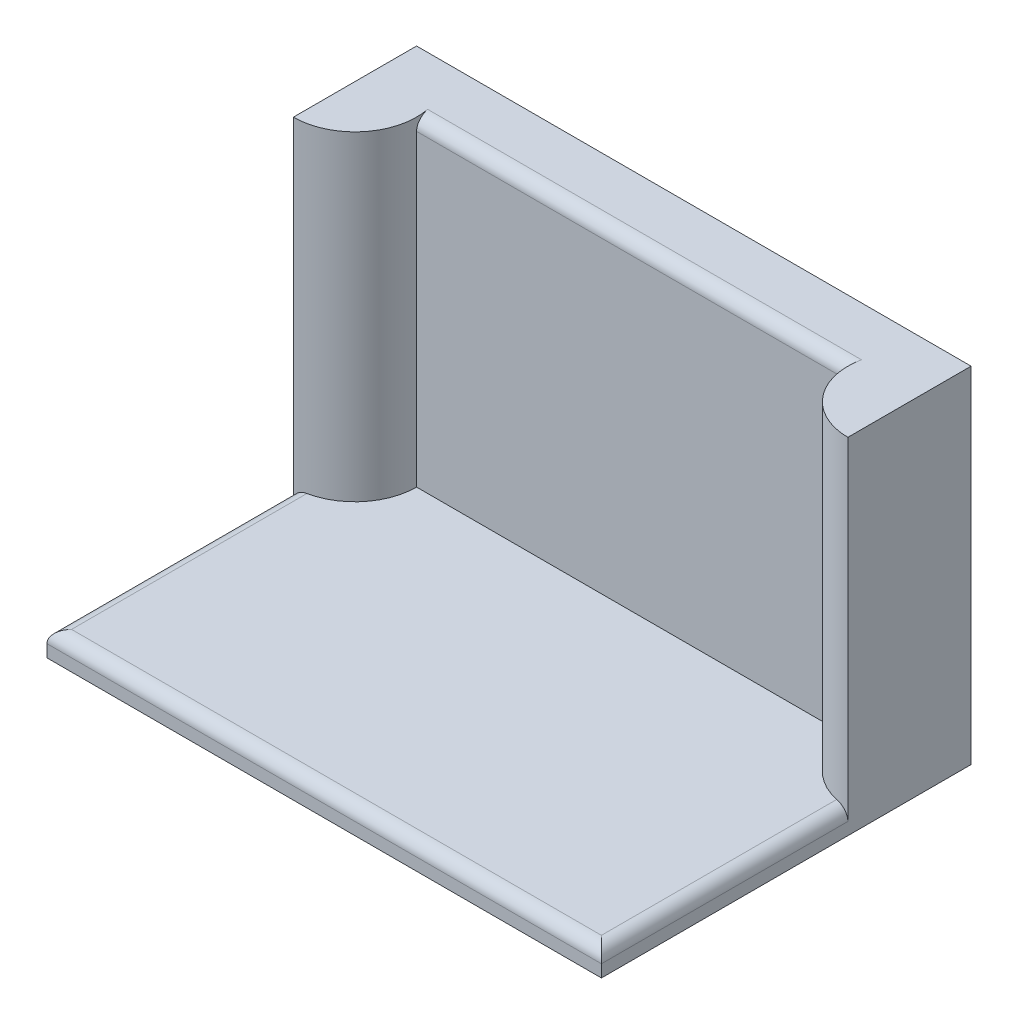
ISO-10303-21;
HEADER;
FILE_DESCRIPTION(('STEP AP214'),'2;1');
FILE_NAME('part.step','',(''),(''),'','','');
FILE_SCHEMA(('AUTOMOTIVE_DESIGN { 1 0 10303 214 1 1 1 1 }'));
ENDSEC;
DATA;
#1=APPLICATION_CONTEXT('core data for automotive mechanical design processes');
#2=APPLICATION_PROTOCOL_DEFINITION('international standard','automotive_design',2000,#1);
#3=PRODUCT_CONTEXT('',#1,'mechanical');
#4=PRODUCT('Part','Part','',(#3));
#5=PRODUCT_RELATED_PRODUCT_CATEGORY('part','',(#4));
#6=PRODUCT_DEFINITION_FORMATION('','',#4);
#7=PRODUCT_DEFINITION_CONTEXT('part definition',#1,'design');
#8=PRODUCT_DEFINITION('design','',#6,#7);
#9=PRODUCT_DEFINITION_SHAPE('','',#8);
#10=(LENGTH_UNIT() NAMED_UNIT(*) SI_UNIT(.MILLI.,.METRE.));
#11=(NAMED_UNIT(*) PLANE_ANGLE_UNIT() SI_UNIT($,.RADIAN.));
#12=(NAMED_UNIT(*) SI_UNIT($,.STERADIAN.) SOLID_ANGLE_UNIT());
#13=UNCERTAINTY_MEASURE_WITH_UNIT(LENGTH_MEASURE(1.E-05),#10,'distance_accuracy_value','');
#14=(GEOMETRIC_REPRESENTATION_CONTEXT(3) GLOBAL_UNCERTAINTY_ASSIGNED_CONTEXT((#13)) GLOBAL_UNIT_ASSIGNED_CONTEXT((#10,
#11,#12)) REPRESENTATION_CONTEXT('',''));
#15=CARTESIAN_POINT('',(0.,0.,0.));
#16=DIRECTION('',(0.,0.,1.));
#17=DIRECTION('',(1.,0.,0.));
#18=AXIS2_PLACEMENT_3D('',#15,#16,#17);
#19=CARTESIAN_POINT('',(450.,-20.4291045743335,36.2809389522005));
#20=DIRECTION('',(1.,0.,0.));
#21=DIRECTION('',(0.,0.,-1.));
#22=AXIS2_PLACEMENT_3D('',#19,#20,#21);
#23=CYLINDRICAL_SURFACE('',#22,10.);
#24=CARTESIAN_POINT('',(440.,-20.4291045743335,36.2809389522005));
#25=DIRECTION('',(0.707106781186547,0.,-0.707106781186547));
#26=DIRECTION('',(-0.707106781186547,0.,-0.707106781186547));
#27=AXIS2_PLACEMENT_3D('',#24,#25,#26);
#28=ELLIPSE('',#27,14.1421356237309,10.);
#29=CARTESIAN_POINT('',(440.,-10.4291045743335,36.2809389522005));
#30=VERTEX_POINT('',#29);
#31=CARTESIAN_POINT('',(450.,-20.4291045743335,46.2809389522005));
#32=VERTEX_POINT('',#31);
#33=EDGE_CURVE('E45',#30,#32,#28,.T.);
#34=ORIENTED_EDGE('',*,*,#33,.F.);
#35=DIRECTION('',(1.,0.,0.));
#36=VECTOR('',#35,1.);
#37=CARTESIAN_POINT('',(450.,-10.4291045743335,36.2809389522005));
#38=LINE('',#37,#36);
#39=CARTESIAN_POINT('',(10.,-10.4291045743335,36.2809389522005));
#40=VERTEX_POINT('',#39);
#41=EDGE_CURVE('E237',#40,#30,#38,.T.);
#42=ORIENTED_EDGE('',*,*,#41,.F.);
#43=CARTESIAN_POINT('',(10.,-20.4291045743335,36.2809389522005));
#44=DIRECTION('',(0.707106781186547,0.,0.707106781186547));
#45=DIRECTION('',(0.707106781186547,0.,-0.707106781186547));
#46=AXIS2_PLACEMENT_3D('',#43,#44,#45);
#47=ELLIPSE('',#46,14.1421356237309,10.);
#48=CARTESIAN_POINT('',(0.,-20.4291045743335,46.2809389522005));
#49=VERTEX_POINT('',#48);
#50=EDGE_CURVE('E216',#40,#49,#47,.T.);
#51=ORIENTED_EDGE('',*,*,#50,.T.);
#52=DIRECTION('',(1.,0.,0.));
#53=VECTOR('',#52,1.);
#54=CARTESIAN_POINT('',(450.,-20.4291045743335,46.2809389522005));
#55=LINE('',#54,#53);
#56=EDGE_CURVE('E239',#32,#49,#55,.F.);
#57=ORIENTED_EDGE('',*,*,#56,.F.);
#58=EDGE_LOOP('',(#34,#42,#51,#57));
#59=FACE_BOUND('',#58,.T.);
#60=ADVANCED_FACE('F33',(#59),#23,.T.);
#61=CARTESIAN_POINT('',(10.,-20.4291045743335,46.2809389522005));
#62=DIRECTION('',(0.,0.,-1.));
#63=DIRECTION('',(-1.,0.,0.));
#64=AXIS2_PLACEMENT_3D('',#61,#62,#63);
#65=CYLINDRICAL_SURFACE('',#64,10.);
#66=ORIENTED_EDGE('',*,*,#50,.F.);
#67=DIRECTION('',(0.,0.,1.));
#68=VECTOR('',#67,1.);
#69=CARTESIAN_POINT('',(10.,-10.4291045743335,46.2809389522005));
#70=LINE('',#69,#68);
#71=CARTESIAN_POINT('',(10.,-10.4291045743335,-154.729266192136));
#72=VERTEX_POINT('',#71);
#73=EDGE_CURVE('E249',#72,#40,#70,.T.);
#74=ORIENTED_EDGE('',*,*,#73,.F.);
#75=CARTESIAN_POINT('',(10.,-10.4291045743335,-154.729266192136));
#76=CARTESIAN_POINT('',(9.72494660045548,-10.4290731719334,-154.673097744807));
#77=CARTESIAN_POINT('',(9.44939749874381,-10.4404518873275,-154.619287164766));
#78=CARTESIAN_POINT('',(8.89924855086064,-10.4860480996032,-154.516611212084));
#79=CARTESIAN_POINT('',(8.62464878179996,-10.5202674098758,-154.467746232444));
#80=CARTESIAN_POINT('',(8.07851953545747,-10.6115406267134,-154.375223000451));
#81=CARTESIAN_POINT('',(7.80698859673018,-10.6685831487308,-154.331562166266));
#82=CARTESIAN_POINT('',(7.26888086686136,-10.8052782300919,-154.249500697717));
#83=CARTESIAN_POINT('',(7.00230381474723,-10.8849295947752,-154.211099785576));
#84=CARTESIAN_POINT('',(6.47579397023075,-11.0665402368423,-154.13948081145));
#85=CARTESIAN_POINT('',(6.21586912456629,-11.1685249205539,-154.106268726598));
#86=CARTESIAN_POINT('',(5.70496619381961,-11.3941356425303,-154.04492731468));
#87=CARTESIAN_POINT('',(5.45398806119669,-11.5177615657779,-154.016797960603));
#88=CARTESIAN_POINT('',(4.96297938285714,-11.7858046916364,-153.965370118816));
#89=CARTESIAN_POINT('',(4.72294533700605,-11.9302151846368,-153.942070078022));
#90=CARTESIAN_POINT('',(4.2555749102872,-12.2388662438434,-153.899936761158));
#91=CARTESIAN_POINT('',(4.02823834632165,-12.4031065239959,-153.881103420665));
#92=CARTESIAN_POINT('',(3.5902521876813,-12.7484724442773,-153.847647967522));
#93=CARTESIAN_POINT('',(3.37945488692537,-12.929406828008,-153.832984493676));
#94=CARTESIAN_POINT('',(2.97353269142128,-13.3083012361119,-153.807143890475));
#95=CARTESIAN_POINT('',(2.77840773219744,-13.5062611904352,-153.795966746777));
#96=CARTESIAN_POINT('',(2.40522864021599,-13.9178358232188,-153.776596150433));
#97=CARTESIAN_POINT('',(2.22717623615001,-14.1314520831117,-153.768402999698));
#98=CARTESIAN_POINT('',(1.88944252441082,-14.5728194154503,-153.754487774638));
#99=CARTESIAN_POINT('',(1.72976128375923,-14.800570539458,-153.748765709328));
#100=CARTESIAN_POINT('',(1.42926668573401,-15.2696053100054,-153.739266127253));
#101=CARTESIAN_POINT('',(1.2885365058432,-15.510942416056,-153.735496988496));
#102=CARTESIAN_POINT('',(1.02774836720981,-16.0045573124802,-153.729454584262));
#103=CARTESIAN_POINT('',(0.90769054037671,-16.2568351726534,-153.72718132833));
#104=CARTESIAN_POINT('',(0.689084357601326,-16.7705818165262,-153.723690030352));
#105=CARTESIAN_POINT('',(0.590538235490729,-17.032051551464,-153.722472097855));
#106=CARTESIAN_POINT('',(0.415664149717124,-17.5623207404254,-153.720712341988));
#107=CARTESIAN_POINT('',(0.339336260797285,-17.8311202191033,-153.720170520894));
#108=CARTESIAN_POINT('',(0.209083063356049,-18.3756363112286,-153.719455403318));
#109=CARTESIAN_POINT('',(0.155281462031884,-18.6513825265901,-153.71928412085));
#110=CARTESIAN_POINT('',(0.0710591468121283,-19.2064276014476,-153.719094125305));
#111=CARTESIAN_POINT('',(0.0406388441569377,-19.4857265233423,-153.719075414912));
#112=CARTESIAN_POINT('',(0.00339040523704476,-20.0461224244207,-153.719056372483));
#113=CARTESIAN_POINT('',(-0.00341841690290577,-20.3272206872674,-153.71905605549));
#114=CARTESIAN_POINT('',(0.00662308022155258,-20.8890056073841,-153.719066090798));
#115=CARTESIAN_POINT('',(0.0234744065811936,-21.1696922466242,-153.719076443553));
#116=CARTESIAN_POINT('',(0.0521626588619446,-21.4491693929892,-153.719088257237));
#117=B_SPLINE_CURVE_WITH_KNOTS('',3,(#75,#76,#77,#78,#79,#80,#81,#82,#83,#84,#85,#86,#87,#88,
#89,#90,#91,#92,#93,#94,#95,#96,#97,#98,#99,#100,#101,#102,#103,#104,#105,#106,#107,#108,#109,
#110,#111,#112,#113,#114,#115,#116),.UNSPECIFIED.,.F.,.F.,(4,2,2,2,2,2,2,2,2,2,2,2,2,2,2,2,2,2,
2,2,4),(0.,0.84196959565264,1.68400604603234,2.52562299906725,3.36719548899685,4.2097303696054,
5.05226077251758,5.89451979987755,6.73676667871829,7.5703420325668,8.40391395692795,
9.23757019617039,10.0712294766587,10.9084361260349,11.7456481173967,12.582947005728,
13.4202487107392,14.2620901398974,15.1039463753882,15.9464910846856,16.7890716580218),.UNSPECIFIED.);
#118=CARTESIAN_POINT('',(0.,-20.4291045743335,-153.7190610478));
#119=VERTEX_POINT('',#118);
#120=EDGE_CURVE('E208',#72,#119,#117,.T.);
#121=ORIENTED_EDGE('',*,*,#120,.T.);
#122=DIRECTION('',(0.,0.,1.));
#123=VECTOR('',#122,1.);
#124=CARTESIAN_POINT('',(0.,-20.4291045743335,46.2809389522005));
#125=LINE('',#124,#123);
#126=EDGE_CURVE('E253',#49,#119,#125,.F.);
#127=ORIENTED_EDGE('',*,*,#126,.F.);
#128=EDGE_LOOP('',(#66,#74,#121,#127));
#129=FACE_BOUND('',#128,.T.);
#130=ADVANCED_FACE('F219',(#129),#65,.T.);
#131=CARTESIAN_POINT('',(440.,-20.4291045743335,46.2809389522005));
#132=DIRECTION('',(0.,0.,-1.));
#133=DIRECTION('',(-1.,0.,0.));
#134=AXIS2_PLACEMENT_3D('',#131,#132,#133);
#135=CYLINDRICAL_SURFACE('',#134,10.);
#136=DIRECTION('',(0.,0.,-1.));
#137=VECTOR('',#136,1.);
#138=CARTESIAN_POINT('',(440.,-10.4291045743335,46.2809389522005));
#139=LINE('',#138,#137);
#140=CARTESIAN_POINT('',(440.,-10.4291045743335,-154.729266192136));
#141=VERTEX_POINT('',#140);
#142=EDGE_CURVE('E247',#30,#141,#139,.T.);
#143=ORIENTED_EDGE('',*,*,#142,.F.);
#144=ORIENTED_EDGE('',*,*,#33,.T.);
#145=DIRECTION('',(0.,0.,-1.));
#146=VECTOR('',#145,1.);
#147=CARTESIAN_POINT('',(450.,-20.4291045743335,0.));
#148=LINE('',#147,#146);
#149=CARTESIAN_POINT('',(450.,-20.4291045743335,-153.7190610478));
#150=VERTEX_POINT('',#149);
#151=EDGE_CURVE('E217',#150,#32,#148,.F.);
#152=ORIENTED_EDGE('',*,*,#151,.F.);
#153=CARTESIAN_POINT('',(440.,-10.4291045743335,-154.729266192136));
#154=CARTESIAN_POINT('',(440.275053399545,-10.4290731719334,-154.673097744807));
#155=CARTESIAN_POINT('',(440.550602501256,-10.4404518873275,-154.619287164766));
#156=CARTESIAN_POINT('',(441.100751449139,-10.4860480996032,-154.516611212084));
#157=CARTESIAN_POINT('',(441.3753512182,-10.5202674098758,-154.467746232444));
#158=CARTESIAN_POINT('',(441.921480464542,-10.6115406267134,-154.375223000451));
#159=CARTESIAN_POINT('',(442.19301140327,-10.6685831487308,-154.331562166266));
#160=CARTESIAN_POINT('',(442.731119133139,-10.8052782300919,-154.249500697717));
#161=CARTESIAN_POINT('',(442.997696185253,-10.8849295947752,-154.211099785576));
#162=CARTESIAN_POINT('',(443.524206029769,-11.0665402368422,-154.13948081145));
#163=CARTESIAN_POINT('',(443.784130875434,-11.1685249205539,-154.106268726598));
#164=CARTESIAN_POINT('',(444.29503380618,-11.3941356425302,-154.04492731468));
#165=CARTESIAN_POINT('',(444.546011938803,-11.5177615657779,-154.016797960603));
#166=CARTESIAN_POINT('',(445.037020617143,-11.7858046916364,-153.965370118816));
#167=CARTESIAN_POINT('',(445.277054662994,-11.9302151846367,-153.942070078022));
#168=CARTESIAN_POINT('',(445.744425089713,-12.2388662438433,-153.899936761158));
#169=CARTESIAN_POINT('',(445.971761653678,-12.4031065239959,-153.881103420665));
#170=CARTESIAN_POINT('',(446.409747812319,-12.7484724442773,-153.847647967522));
#171=CARTESIAN_POINT('',(446.620545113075,-12.929406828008,-153.832984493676));
#172=CARTESIAN_POINT('',(447.026467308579,-13.3083012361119,-153.807143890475));
#173=CARTESIAN_POINT('',(447.221592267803,-13.5062611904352,-153.795966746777));
#174=CARTESIAN_POINT('',(447.594771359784,-13.9178358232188,-153.776596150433));
#175=CARTESIAN_POINT('',(447.77282376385,-14.1314520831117,-153.768402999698));
#176=CARTESIAN_POINT('',(448.110557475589,-14.5728194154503,-153.754487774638));
#177=CARTESIAN_POINT('',(448.270238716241,-14.800570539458,-153.748765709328));
#178=CARTESIAN_POINT('',(448.570733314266,-15.2696053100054,-153.739266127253));
#179=CARTESIAN_POINT('',(448.711463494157,-15.510942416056,-153.735496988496));
#180=CARTESIAN_POINT('',(448.97225163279,-16.0045573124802,-153.729454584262));
#181=CARTESIAN_POINT('',(449.092309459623,-16.2568351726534,-153.72718132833));
#182=CARTESIAN_POINT('',(449.310915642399,-16.7705818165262,-153.723690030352));
#183=CARTESIAN_POINT('',(449.409461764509,-17.032051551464,-153.722472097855));
#184=CARTESIAN_POINT('',(449.584335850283,-17.5623207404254,-153.720712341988));
#185=CARTESIAN_POINT('',(449.660663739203,-17.8311202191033,-153.720170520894));
#186=CARTESIAN_POINT('',(449.790916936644,-18.3756363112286,-153.719455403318));
#187=CARTESIAN_POINT('',(449.844718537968,-18.6513825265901,-153.71928412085));
#188=CARTESIAN_POINT('',(449.928940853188,-19.2064276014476,-153.719094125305));
#189=CARTESIAN_POINT('',(449.959361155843,-19.4857265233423,-153.719075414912));
#190=CARTESIAN_POINT('',(449.996609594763,-20.0461224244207,-153.719056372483));
#191=CARTESIAN_POINT('',(450.003418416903,-20.3272206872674,-153.71905605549));
#192=CARTESIAN_POINT('',(449.993376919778,-20.8890056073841,-153.719066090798));
#193=CARTESIAN_POINT('',(449.976525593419,-21.1696922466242,-153.719076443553));
#194=CARTESIAN_POINT('',(449.947837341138,-21.4491693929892,-153.719088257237));
#195=B_SPLINE_CURVE_WITH_KNOTS('',3,(#153,#154,#155,#156,#157,#158,#159,#160,#161,#162,#163,
#164,#165,#166,#167,#168,#169,#170,#171,#172,#173,#174,#175,#176,#177,#178,#179,#180,#181,#182,
#183,#184,#185,#186,#187,#188,#189,#190,#191,#192,#193,#194),.UNSPECIFIED.,.F.,.F.,(4,2,2,2,2,2,
2,2,2,2,2,2,2,2,2,2,2,2,2,2,4),(0.,0.841969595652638,1.68400604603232,2.52562299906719,
3.36719548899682,4.20973036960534,5.05226077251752,5.89451979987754,6.73676667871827,
7.5703420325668,8.40391395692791,9.23757019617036,10.0712294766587,10.9084361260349,
11.7456481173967,12.582947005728,13.4202487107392,14.2620901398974,15.1039463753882,
15.9464910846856,16.7890716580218),.UNSPECIFIED.);
#196=EDGE_CURVE('E11',#150,#141,#195,.F.);
#197=ORIENTED_EDGE('',*,*,#196,.T.);
#198=EDGE_LOOP('',(#143,#144,#152,#197));
#199=FACE_BOUND('',#198,.T.);
#200=ADVANCED_FACE('F222',(#199),#135,.T.);
#201=CARTESIAN_POINT('',(450.,239.570895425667,-213.7190610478));
#202=DIRECTION('',(1.,0.,0.));
#203=DIRECTION('',(0.,0.,-1.));
#204=AXIS2_PLACEMENT_3D('',#201,#202,#203);
#205=CYLINDRICAL_SURFACE('',#204,10.);
#206=DIRECTION('',(1.,0.,0.));
#207=VECTOR('',#206,1.);
#208=CARTESIAN_POINT('',(450.,249.570895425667,-213.7190610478));
#209=LINE('',#208,#207);
#210=CARTESIAN_POINT('',(48.9897948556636,249.570895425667,-213.7190610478));
#211=VERTEX_POINT('',#210);
#212=CARTESIAN_POINT('',(401.010205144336,249.570895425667,-213.7190610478));
#213=VERTEX_POINT('',#212);
#214=EDGE_CURVE('E125',#211,#213,#209,.T.);
#215=ORIENTED_EDGE('',*,*,#214,.F.);
#216=CARTESIAN_POINT('',(50.,239.570895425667,-203.7190610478));
#217=CARTESIAN_POINT('',(49.9999821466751,239.852051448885,-203.719030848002));
#218=CARTESIAN_POINT('',(49.9999994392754,240.133203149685,-203.730917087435));
#219=CARTESIAN_POINT('',(49.9999752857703,240.693496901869,-203.778304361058));
#220=CARTESIAN_POINT('',(49.9999338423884,240.972639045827,-203.813804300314));
#221=CARTESIAN_POINT('',(49.9996633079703,241.526735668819,-203.908166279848));
#222=CARTESIAN_POINT('',(49.9994343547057,241.801693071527,-203.967011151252));
#223=CARTESIAN_POINT('',(49.9985398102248,242.345674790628,-204.107635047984));
#224=CARTESIAN_POINT('',(49.9978742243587,242.61469917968,-204.189413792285));
#225=CARTESIAN_POINT('',(49.9957786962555,243.14504090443,-204.375373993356));
#226=CARTESIAN_POINT('',(49.9943483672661,243.406354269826,-204.479566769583));
#227=CARTESIAN_POINT('',(49.9903199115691,243.919269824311,-204.709586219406));
#228=CARTESIAN_POINT('',(49.9877217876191,244.17087203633,-204.835412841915));
#229=CARTESIAN_POINT('',(49.9808962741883,244.662544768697,-205.107784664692));
#230=CARTESIAN_POINT('',(49.9766690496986,244.902616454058,-205.254327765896));
#231=CARTESIAN_POINT('',(49.9660813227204,245.369535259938,-205.56708385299));
#232=CARTESIAN_POINT('',(49.9597208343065,245.596382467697,-205.733296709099));
#233=CARTESIAN_POINT('',(49.9443516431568,246.034872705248,-206.08390092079));
#234=CARTESIAN_POINT('',(49.9353472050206,246.246539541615,-206.26826268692));
#235=CARTESIAN_POINT('',(49.914158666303,246.653551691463,-206.654034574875));
#236=CARTESIAN_POINT('',(49.9019745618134,246.848896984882,-206.855444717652));
#237=CARTESIAN_POINT('',(49.8739197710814,247.221837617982,-207.273784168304));
#238=CARTESIAN_POINT('',(49.858049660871,247.399435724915,-207.490711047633));
#239=CARTESIAN_POINT('',(49.8221530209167,247.735653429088,-207.938480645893));
#240=CARTESIAN_POINT('',(49.8021265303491,247.894273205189,-208.169323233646));
#241=CARTESIAN_POINT('',(49.7576667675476,248.19037933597,-208.641501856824));
#242=CARTESIAN_POINT('',(49.7332655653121,248.328006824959,-208.882752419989));
#243=CARTESIAN_POINT('',(49.6796421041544,248.582542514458,-209.375433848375));
#244=CARTESIAN_POINT('',(49.6504198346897,248.699450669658,-209.626864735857));
#245=CARTESIAN_POINT('',(49.5869162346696,248.911847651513,-210.138103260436));
#246=CARTESIAN_POINT('',(49.5526331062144,249.007328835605,-210.397913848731));
#247=CARTESIAN_POINT('',(49.4788950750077,249.176273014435,-210.923883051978));
#248=CARTESIAN_POINT('',(49.4394401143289,249.249735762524,-211.190041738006));
#249=CARTESIAN_POINT('',(49.3554163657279,249.37419586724,-211.726333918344));
#250=CARTESIAN_POINT('',(49.3108553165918,249.425226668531,-211.996460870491));
#251=CARTESIAN_POINT('',(49.2166841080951,249.504828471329,-212.539145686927));
#252=CARTESIAN_POINT('',(49.167073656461,249.533398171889,-212.811703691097));
#253=CARTESIAN_POINT('',(49.0630216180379,249.568089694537,-213.357365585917));
#254=CARTESIAN_POINT('',(49.0085792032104,249.574207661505,-213.630469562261));
#255=CARTESIAN_POINT('',(48.8952429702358,249.564203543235,-214.175313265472));
#256=CARTESIAN_POINT('',(48.8363496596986,249.548083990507,-214.447053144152));
#257=CARTESIAN_POINT('',(48.7754108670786,249.52095559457,-214.717210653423));
#258=B_SPLINE_CURVE_WITH_KNOTS('',3,(#216,#217,#218,#219,#220,#221,#222,#223,#224,#225,#226,
#227,#228,#229,#230,#231,#232,#233,#234,#235,#236,#237,#238,#239,#240,#241,#242,#243,#244,#245,
#246,#247,#248,#249,#250,#251,#252,#253,#254,#255,#256,#257),.UNSPECIFIED.,.F.,.F.,(4,2,2,2,2,2,
2,2,2,2,2,2,2,2,2,2,2,2,2,2,4),(0.,0.843210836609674,1.68638257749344,2.52893535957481,
3.37147781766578,4.21444677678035,5.05741374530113,5.90029536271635,6.74317141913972,
7.58469534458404,8.4262203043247,9.26761384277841,10.1089994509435,10.9444520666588,
11.7799065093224,12.6156584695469,13.4514197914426,14.2859307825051,15.1204901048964,
15.9551927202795,16.7898002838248),.UNSPECIFIED.);
#259=CARTESIAN_POINT('',(50.,239.570895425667,-203.7190610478));
#260=VERTEX_POINT('',#259);
#261=EDGE_CURVE('E180',#211,#260,#258,.F.);
#262=ORIENTED_EDGE('',*,*,#261,.T.);
#263=DIRECTION('',(1.,0.,0.));
#264=VECTOR('',#263,1.);
#265=CARTESIAN_POINT('',(450.,239.570895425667,-203.7190610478));
#266=LINE('',#265,#264);
#267=CARTESIAN_POINT('',(400.,239.570895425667,-203.7190610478));
#268=VERTEX_POINT('',#267);
#269=EDGE_CURVE('E177',#268,#260,#266,.F.);
#270=ORIENTED_EDGE('',*,*,#269,.F.);
#271=CARTESIAN_POINT('',(400.,239.570895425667,-203.7190610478));
#272=CARTESIAN_POINT('',(400.000017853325,239.852051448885,-203.719030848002));
#273=CARTESIAN_POINT('',(400.000000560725,240.133203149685,-203.730917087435));
#274=CARTESIAN_POINT('',(400.00002471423,240.693496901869,-203.778304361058));
#275=CARTESIAN_POINT('',(400.000066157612,240.972639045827,-203.813804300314));
#276=CARTESIAN_POINT('',(400.00033669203,241.526735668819,-203.908166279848));
#277=CARTESIAN_POINT('',(400.000565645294,241.801693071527,-203.967011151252));
#278=CARTESIAN_POINT('',(400.001460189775,242.345674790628,-204.107635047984));
#279=CARTESIAN_POINT('',(400.002125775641,242.61469917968,-204.189413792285));
#280=CARTESIAN_POINT('',(400.004221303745,243.14504090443,-204.375373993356));
#281=CARTESIAN_POINT('',(400.005651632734,243.406354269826,-204.479566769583));
#282=CARTESIAN_POINT('',(400.009680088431,243.919269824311,-204.709586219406));
#283=CARTESIAN_POINT('',(400.012278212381,244.17087203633,-204.835412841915));
#284=CARTESIAN_POINT('',(400.019103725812,244.662544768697,-205.107784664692));
#285=CARTESIAN_POINT('',(400.023330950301,244.902616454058,-205.254327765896));
#286=CARTESIAN_POINT('',(400.03391867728,245.369535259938,-205.56708385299));
#287=CARTESIAN_POINT('',(400.040279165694,245.596382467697,-205.733296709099));
#288=CARTESIAN_POINT('',(400.055648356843,246.034872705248,-206.08390092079));
#289=CARTESIAN_POINT('',(400.064652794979,246.246539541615,-206.26826268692));
#290=CARTESIAN_POINT('',(400.085841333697,246.653551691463,-206.654034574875));
#291=CARTESIAN_POINT('',(400.098025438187,246.848896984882,-206.855444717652));
#292=CARTESIAN_POINT('',(400.126080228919,247.221837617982,-207.273784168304));
#293=CARTESIAN_POINT('',(400.141950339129,247.399435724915,-207.490711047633));
#294=CARTESIAN_POINT('',(400.177846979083,247.735653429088,-207.938480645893));
#295=CARTESIAN_POINT('',(400.197873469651,247.894273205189,-208.169323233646));
#296=CARTESIAN_POINT('',(400.242333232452,248.19037933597,-208.641501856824));
#297=CARTESIAN_POINT('',(400.266734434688,248.328006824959,-208.882752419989));
#298=CARTESIAN_POINT('',(400.320357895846,248.582542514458,-209.375433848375));
#299=CARTESIAN_POINT('',(400.34958016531,248.699450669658,-209.626864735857));
#300=CARTESIAN_POINT('',(400.41308376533,248.911847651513,-210.138103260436));
#301=CARTESIAN_POINT('',(400.447366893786,249.007328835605,-210.397913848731));
#302=CARTESIAN_POINT('',(400.521104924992,249.176273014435,-210.923883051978));
#303=CARTESIAN_POINT('',(400.560559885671,249.249735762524,-211.190041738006));
#304=CARTESIAN_POINT('',(400.644583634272,249.37419586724,-211.726333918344));
#305=CARTESIAN_POINT('',(400.689144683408,249.425226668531,-211.996460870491));
#306=CARTESIAN_POINT('',(400.783315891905,249.504828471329,-212.539145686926));
#307=CARTESIAN_POINT('',(400.832926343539,249.533398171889,-212.811703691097));
#308=CARTESIAN_POINT('',(400.936978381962,249.568089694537,-213.357365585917));
#309=CARTESIAN_POINT('',(400.99142079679,249.574207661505,-213.630469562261));
#310=CARTESIAN_POINT('',(401.104757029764,249.564203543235,-214.175313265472));
#311=CARTESIAN_POINT('',(401.163650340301,249.548083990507,-214.447053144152));
#312=CARTESIAN_POINT('',(401.224589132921,249.52095559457,-214.717210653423));
#313=B_SPLINE_CURVE_WITH_KNOTS('',3,(#271,#272,#273,#274,#275,#276,#277,#278,#279,#280,#281,
#282,#283,#284,#285,#286,#287,#288,#289,#290,#291,#292,#293,#294,#295,#296,#297,#298,#299,#300,
#301,#302,#303,#304,#305,#306,#307,#308,#309,#310,#311,#312),.UNSPECIFIED.,.F.,.F.,(4,2,2,2,2,2,
2,2,2,2,2,2,2,2,2,2,2,2,2,2,4),(0.,0.843210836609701,1.68638257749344,2.52893535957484,
3.37147781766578,4.21444677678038,5.05741374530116,5.90029536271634,6.7431714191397,
7.58469534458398,8.42622030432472,9.26761384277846,10.1089994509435,10.9444520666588,
11.7799065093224,12.6156584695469,13.4514197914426,14.285930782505,15.1204901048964,
15.9551927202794,16.7898002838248),.UNSPECIFIED.);
#314=EDGE_CURVE('E188',#268,#213,#313,.T.);
#315=ORIENTED_EDGE('',*,*,#314,.T.);
#316=EDGE_LOOP('',(#215,#262,#270,#315));
#317=FACE_BOUND('',#316,.T.);
#318=ADVANCED_FACE('F194',(#317),#205,.T.);
#319=CARTESIAN_POINT('',(450.,0.,-203.7190610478));
#320=DIRECTION('',(0.,-1.,0.));
#321=DIRECTION('',(1.,0.,0.));
#322=AXIS2_PLACEMENT_3D('',#319,#320,#321);
#323=CYLINDRICAL_SURFACE('',#322,50.);
#324=DIRECTION('',(0.,1.,0.));
#325=VECTOR('',#324,1.);
#326=CARTESIAN_POINT('',(450.,249.570895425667,-153.7190610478));
#327=LINE('',#326,#325);
#328=CARTESIAN_POINT('',(450.,249.570895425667,-153.7190610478));
#329=VERTEX_POINT('',#328);
#330=EDGE_CURVE('E52',#150,#329,#327,.T.);
#331=ORIENTED_EDGE('',*,*,#330,.T.);
#332=CARTESIAN_POINT('',(450.,249.570895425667,-203.7190610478));
#333=DIRECTION('',(0.,-1.,0.));
#334=DIRECTION('',(0.,0.,-1.));
#335=AXIS2_PLACEMENT_3D('',#332,#333,#334);
#336=CIRCLE('',#335,50.);
#337=EDGE_CURVE('E120',#213,#329,#336,.F.);
#338=ORIENTED_EDGE('',*,*,#337,.F.);
#339=ORIENTED_EDGE('',*,*,#314,.F.);
#340=DIRECTION('',(0.,-1.,0.));
#341=VECTOR('',#340,1.);
#342=CARTESIAN_POINT('',(400.,249.570895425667,-203.7190610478));
#343=LINE('',#342,#341);
#344=CARTESIAN_POINT('',(400.,-10.4291045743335,-203.7190610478));
#345=VERTEX_POINT('',#344);
#346=EDGE_CURVE('E140',#268,#345,#343,.T.);
#347=ORIENTED_EDGE('',*,*,#346,.T.);
#348=CARTESIAN_POINT('',(450.,-10.4291045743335,-203.7190610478));
#349=DIRECTION('',(0.,-1.,0.));
#350=DIRECTION('',(0.,0.,-1.));
#351=AXIS2_PLACEMENT_3D('',#348,#349,#350);
#352=CIRCLE('',#351,50.);
#353=EDGE_CURVE('E128',#345,#141,#352,.F.);
#354=ORIENTED_EDGE('',*,*,#353,.T.);
#355=ORIENTED_EDGE('',*,*,#196,.F.);
#356=EDGE_LOOP('',(#331,#338,#339,#347,#354,#355));
#357=FACE_BOUND('',#356,.T.);
#358=ADVANCED_FACE('F137',(#357),#323,.T.);
#359=CARTESIAN_POINT('',(0.,249.570895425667,-203.7190610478));
#360=DIRECTION('',(0.,1.,0.));
#361=DIRECTION('',(-1.,0.,0.));
#362=AXIS2_PLACEMENT_3D('',#359,#360,#361);
#363=CYLINDRICAL_SURFACE('',#362,50.);
#364=DIRECTION('',(0.,1.,0.));
#365=VECTOR('',#364,1.);
#366=CARTESIAN_POINT('',(50.,249.570895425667,-203.7190610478));
#367=LINE('',#366,#365);
#368=CARTESIAN_POINT('',(50.,-10.4291045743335,-203.7190610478));
#369=VERTEX_POINT('',#368);
#370=EDGE_CURVE('E139',#369,#260,#367,.T.);
#371=ORIENTED_EDGE('',*,*,#370,.T.);
#372=ORIENTED_EDGE('',*,*,#261,.F.);
#373=CARTESIAN_POINT('',(0.,249.570895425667,-203.7190610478));
#374=DIRECTION('',(0.,-1.,0.));
#375=DIRECTION('',(0.,0.,-1.));
#376=AXIS2_PLACEMENT_3D('',#373,#374,#375);
#377=CIRCLE('',#376,50.);
#378=CARTESIAN_POINT('',(0.,249.570895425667,-153.7190610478));
#379=VERTEX_POINT('',#378);
#380=EDGE_CURVE('E172',#379,#211,#377,.F.);
#381=ORIENTED_EDGE('',*,*,#380,.F.);
#382=DIRECTION('',(0.,-1.,0.));
#383=VECTOR('',#382,1.);
#384=CARTESIAN_POINT('',(0.,249.570895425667,-153.7190610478));
#385=LINE('',#384,#383);
#386=EDGE_CURVE('E143',#379,#119,#385,.T.);
#387=ORIENTED_EDGE('',*,*,#386,.T.);
#388=ORIENTED_EDGE('',*,*,#120,.F.);
#389=CARTESIAN_POINT('',(0.,-10.4291045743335,-203.7190610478));
#390=DIRECTION('',(0.,-1.,0.));
#391=DIRECTION('',(0.,0.,-1.));
#392=AXIS2_PLACEMENT_3D('',#389,#390,#391);
#393=CIRCLE('',#392,50.);
#394=EDGE_CURVE('E129',#72,#369,#393,.F.);
#395=ORIENTED_EDGE('',*,*,#394,.T.);
#396=EDGE_LOOP('',(#371,#372,#381,#387,#388,#395));
#397=FACE_BOUND('',#396,.T.);
#398=ADVANCED_FACE('F197',(#397),#363,.T.);
#399=CARTESIAN_POINT('',(450.,249.570895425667,-203.7190610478));
#400=DIRECTION('',(0.,0.,-1.));
#401=DIRECTION('',(0.,1.,0.));
#402=AXIS2_PLACEMENT_3D('',#399,#400,#401);
#403=PLANE('',#402);
#404=ORIENTED_EDGE('',*,*,#346,.F.);
#405=ORIENTED_EDGE('',*,*,#269,.T.);
#406=ORIENTED_EDGE('',*,*,#370,.F.);
#407=DIRECTION('',(-1.,0.,0.));
#408=VECTOR('',#407,1.);
#409=CARTESIAN_POINT('',(450.,-10.4291045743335,-203.7190610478));
#410=LINE('',#409,#408);
#411=EDGE_CURVE('E135',#345,#369,#410,.T.);
#412=ORIENTED_EDGE('',*,*,#411,.F.);
#413=EDGE_LOOP('',(#404,#405,#406,#412));
#414=FACE_BOUND('',#413,.T.);
#415=ADVANCED_FACE('F201',(#414),#403,.F.);
#416=CARTESIAN_POINT('',(450.,-10.4291045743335,46.2809389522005));
#417=DIRECTION('',(0.,-1.,0.));
#418=DIRECTION('',(0.,0.,-1.));
#419=AXIS2_PLACEMENT_3D('',#416,#417,#418);
#420=PLANE('',#419);
#421=ORIENTED_EDGE('',*,*,#394,.F.);
#422=ORIENTED_EDGE('',*,*,#73,.T.);
#423=ORIENTED_EDGE('',*,*,#41,.T.);
#424=ORIENTED_EDGE('',*,*,#142,.T.);
#425=ORIENTED_EDGE('',*,*,#353,.F.);
#426=ORIENTED_EDGE('',*,*,#411,.T.);
#427=EDGE_LOOP('',(#421,#422,#423,#424,#425,#426));
#428=FACE_BOUND('',#427,.T.);
#429=ADVANCED_FACE('F245',(#428),#420,.F.);
#430=CARTESIAN_POINT('',(450.,-30.4291045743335,46.2809389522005));
#431=DIRECTION('',(0.,0.,-1.));
#432=DIRECTION('',(-1.,0.,0.));
#433=AXIS2_PLACEMENT_3D('',#430,#431,#432);
#434=PLANE('',#433);
#435=DIRECTION('',(0.,-1.,0.));
#436=VECTOR('',#435,1.);
#437=CARTESIAN_POINT('',(450.,-30.4291045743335,46.2809389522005));
#438=LINE('',#437,#436);
#439=CARTESIAN_POINT('',(450.,-30.4291045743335,46.2809389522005));
#440=VERTEX_POINT('',#439);
#441=EDGE_CURVE('E149',#32,#440,#438,.T.);
#442=ORIENTED_EDGE('',*,*,#441,.F.);
#443=ORIENTED_EDGE('',*,*,#56,.T.);
#444=DIRECTION('',(0.,-1.,0.));
#445=VECTOR('',#444,1.);
#446=CARTESIAN_POINT('',(0.,-30.4291045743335,46.2809389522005));
#447=LINE('',#446,#445);
#448=CARTESIAN_POINT('',(0.,-30.4291045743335,46.2809389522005));
#449=VERTEX_POINT('',#448);
#450=EDGE_CURVE('E147',#49,#449,#447,.T.);
#451=ORIENTED_EDGE('',*,*,#450,.T.);
#452=DIRECTION('',(-1.,0.,0.));
#453=VECTOR('',#452,1.);
#454=CARTESIAN_POINT('',(450.,-30.4291045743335,46.2809389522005));
#455=LINE('',#454,#453);
#456=EDGE_CURVE('E169',#440,#449,#455,.T.);
#457=ORIENTED_EDGE('',*,*,#456,.F.);
#458=EDGE_LOOP('',(#442,#443,#451,#457));
#459=FACE_BOUND('',#458,.T.);
#460=ADVANCED_FACE('F203',(#459),#434,.F.);
#461=CARTESIAN_POINT('',(450.,-30.4291045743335,46.2809389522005));
#462=DIRECTION('',(0.,1.,0.));
#463=DIRECTION('',(0.,0.,1.));
#464=AXIS2_PLACEMENT_3D('',#461,#462,#463);
#465=PLANE('',#464);
#466=DIRECTION('',(0.,0.,-1.));
#467=VECTOR('',#466,1.);
#468=CARTESIAN_POINT('',(0.,-30.4291045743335,46.2809389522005));
#469=LINE('',#468,#467);
#470=CARTESIAN_POINT('',(0.,-30.4291045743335,-253.719061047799));
#471=VERTEX_POINT('',#470);
#472=EDGE_CURVE('E156',#449,#471,#469,.T.);
#473=ORIENTED_EDGE('',*,*,#472,.T.);
#474=DIRECTION('',(-1.,0.,0.));
#475=VECTOR('',#474,1.);
#476=CARTESIAN_POINT('',(450.,-30.4291045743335,-253.719061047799));
#477=LINE('',#476,#475);
#478=CARTESIAN_POINT('',(450.,-30.4291045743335,-253.719061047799));
#479=VERTEX_POINT('',#478);
#480=EDGE_CURVE('E166',#479,#471,#477,.T.);
#481=ORIENTED_EDGE('',*,*,#480,.F.);
#482=DIRECTION('',(0.,0.,-1.));
#483=VECTOR('',#482,1.);
#484=CARTESIAN_POINT('',(450.,-30.4291045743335,46.2809389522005));
#485=LINE('',#484,#483);
#486=EDGE_CURVE('E151',#440,#479,#485,.T.);
#487=ORIENTED_EDGE('',*,*,#486,.F.);
#488=ORIENTED_EDGE('',*,*,#456,.T.);
#489=EDGE_LOOP('',(#473,#481,#487,#488));
#490=FACE_BOUND('',#489,.T.);
#491=ADVANCED_FACE('F261',(#490),#465,.F.);
#492=CARTESIAN_POINT('',(450.,-30.4291045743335,-253.719061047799));
#493=DIRECTION('',(0.,0.,1.));
#494=DIRECTION('',(1.,0.,0.));
#495=AXIS2_PLACEMENT_3D('',#492,#493,#494);
#496=PLANE('',#495);
#497=DIRECTION('',(0.,1.,0.));
#498=VECTOR('',#497,1.);
#499=CARTESIAN_POINT('',(0.,-30.4291045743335,-253.719061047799));
#500=LINE('',#499,#498);
#501=CARTESIAN_POINT('',(0.,249.570895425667,-253.719061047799));
#502=VERTEX_POINT('',#501);
#503=EDGE_CURVE('E158',#471,#502,#500,.T.);
#504=ORIENTED_EDGE('',*,*,#503,.T.);
#505=DIRECTION('',(-1.,0.,0.));
#506=VECTOR('',#505,1.);
#507=CARTESIAN_POINT('',(450.,249.570895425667,-253.719061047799));
#508=LINE('',#507,#506);
#509=CARTESIAN_POINT('',(450.,249.570895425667,-253.719061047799));
#510=VERTEX_POINT('',#509);
#511=EDGE_CURVE('E164',#510,#502,#508,.T.);
#512=ORIENTED_EDGE('',*,*,#511,.F.);
#513=DIRECTION('',(0.,1.,0.));
#514=VECTOR('',#513,1.);
#515=CARTESIAN_POINT('',(450.,-30.4291045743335,-253.719061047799));
#516=LINE('',#515,#514);
#517=EDGE_CURVE('E133',#479,#510,#516,.T.);
#518=ORIENTED_EDGE('',*,*,#517,.F.);
#519=ORIENTED_EDGE('',*,*,#480,.T.);
#520=EDGE_LOOP('',(#504,#512,#518,#519));
#521=FACE_BOUND('',#520,.T.);
#522=ADVANCED_FACE('F269',(#521),#496,.F.);
#523=CARTESIAN_POINT('',(450.,249.570895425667,-253.719061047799));
#524=DIRECTION('',(0.,-1.,0.));
#525=DIRECTION('',(0.,0.,-1.));
#526=AXIS2_PLACEMENT_3D('',#523,#524,#525);
#527=PLANE('',#526);
#528=ORIENTED_EDGE('',*,*,#380,.T.);
#529=ORIENTED_EDGE('',*,*,#214,.T.);
#530=ORIENTED_EDGE('',*,*,#337,.T.);
#531=DIRECTION('',(0.,0.,1.));
#532=VECTOR('',#531,1.);
#533=CARTESIAN_POINT('',(450.,249.570895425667,-253.719061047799));
#534=LINE('',#533,#532);
#535=EDGE_CURVE('E123',#510,#329,#534,.T.);
#536=ORIENTED_EDGE('',*,*,#535,.F.);
#537=ORIENTED_EDGE('',*,*,#511,.T.);
#538=DIRECTION('',(0.,0.,1.));
#539=VECTOR('',#538,1.);
#540=CARTESIAN_POINT('',(0.,249.570895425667,-253.719061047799));
#541=LINE('',#540,#539);
#542=EDGE_CURVE('E152',#502,#379,#541,.T.);
#543=ORIENTED_EDGE('',*,*,#542,.T.);
#544=EDGE_LOOP('',(#528,#529,#530,#536,#537,#543));
#545=FACE_BOUND('',#544,.T.);
#546=ADVANCED_FACE('F121',(#545),#527,.F.);
#547=CARTESIAN_POINT('',(450.,0.,0.));
#548=DIRECTION('',(-1.,0.,0.));
#549=DIRECTION('',(0.,0.,1.));
#550=AXIS2_PLACEMENT_3D('',#547,#548,#549);
#551=PLANE('',#550);
#552=ORIENTED_EDGE('',*,*,#330,.F.);
#553=ORIENTED_EDGE('',*,*,#151,.T.);
#554=ORIENTED_EDGE('',*,*,#441,.T.);
#555=ORIENTED_EDGE('',*,*,#486,.T.);
#556=ORIENTED_EDGE('',*,*,#517,.T.);
#557=ORIENTED_EDGE('',*,*,#535,.T.);
#558=EDGE_LOOP('',(#552,#553,#554,#555,#556,#557));
#559=FACE_BOUND('',#558,.T.);
#560=ADVANCED_FACE('F131',(#559),#551,.F.);
#561=CARTESIAN_POINT('',(0.,0.,0.));
#562=DIRECTION('',(-1.,0.,0.));
#563=DIRECTION('',(0.,0.,1.));
#564=AXIS2_PLACEMENT_3D('',#561,#562,#563);
#565=PLANE('',#564);
#566=ORIENTED_EDGE('',*,*,#450,.F.);
#567=ORIENTED_EDGE('',*,*,#126,.T.);
#568=ORIENTED_EDGE('',*,*,#386,.F.);
#569=ORIENTED_EDGE('',*,*,#542,.F.);
#570=ORIENTED_EDGE('',*,*,#503,.F.);
#571=ORIENTED_EDGE('',*,*,#472,.F.);
#572=EDGE_LOOP('',(#566,#567,#568,#569,#570,#571));
#573=FACE_BOUND('',#572,.T.);
#574=ADVANCED_FACE('F266',(#573),#565,.T.);
#575=CLOSED_SHELL('',(#60,#130,#200,#318,#358,#398,#415,#429,#460,#491,#522,#546,#560,#574));
#576=MANIFOLD_SOLID_BREP('B2',#575);
#577=ADVANCED_BREP_SHAPE_REPRESENTATION('',(#18,#576),#14);
#578=SHAPE_DEFINITION_REPRESENTATION(#9,#577);
ENDSEC;
END-ISO-10303-21;
